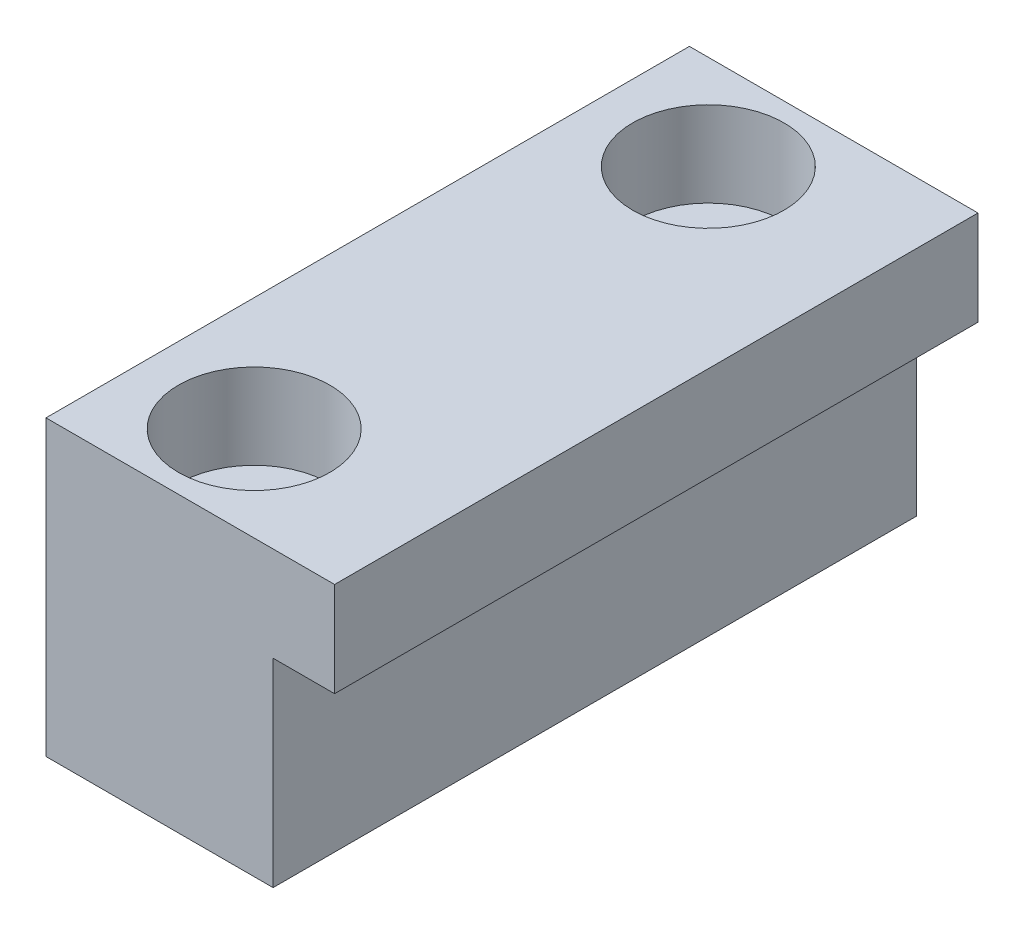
ISO-10303-21;
HEADER;
FILE_DESCRIPTION(('STEP AP214'),'2;1');
FILE_NAME('part.step','',(''),(''),'','','');
FILE_SCHEMA(('AUTOMOTIVE_DESIGN { 1 0 10303 214 1 1 1 1 }'));
ENDSEC;
DATA;
#1=APPLICATION_CONTEXT('core data for automotive mechanical design processes');
#2=APPLICATION_PROTOCOL_DEFINITION('international standard','automotive_design',2000,#1);
#3=PRODUCT_CONTEXT('',#1,'mechanical');
#4=PRODUCT('Part','Part','',(#3));
#5=PRODUCT_RELATED_PRODUCT_CATEGORY('part','',(#4));
#6=PRODUCT_DEFINITION_FORMATION('','',#4);
#7=PRODUCT_DEFINITION_CONTEXT('part definition',#1,'design');
#8=PRODUCT_DEFINITION('design','',#6,#7);
#9=PRODUCT_DEFINITION_SHAPE('','',#8);
#10=(LENGTH_UNIT() NAMED_UNIT(*) SI_UNIT(.MILLI.,.METRE.));
#11=(NAMED_UNIT(*) PLANE_ANGLE_UNIT() SI_UNIT($,.RADIAN.));
#12=(NAMED_UNIT(*) SI_UNIT($,.STERADIAN.) SOLID_ANGLE_UNIT());
#13=UNCERTAINTY_MEASURE_WITH_UNIT(LENGTH_MEASURE(1.E-05),#10,'distance_accuracy_value','');
#14=(GEOMETRIC_REPRESENTATION_CONTEXT(3) GLOBAL_UNCERTAINTY_ASSIGNED_CONTEXT((#13)) GLOBAL_UNIT_ASSIGNED_CONTEXT((#10,
#11,#12)) REPRESENTATION_CONTEXT('',''));
#15=CARTESIAN_POINT('',(0.,0.,0.));
#16=DIRECTION('',(0.,0.,1.));
#17=DIRECTION('',(1.,0.,0.));
#18=AXIS2_PLACEMENT_3D('',#15,#16,#17);
#19=CARTESIAN_POINT('',(6.,-18.5,5.));
#20=DIRECTION('',(0.,1.,0.));
#21=DIRECTION('',(0.,0.,1.));
#22=AXIS2_PLACEMENT_3D('',#19,#20,#21);
#23=CYLINDRICAL_SURFACE('',#22,2.25);
#24=CARTESIAN_POINT('',(6.,0.,5.));
#25=DIRECTION('',(0.,1.,0.));
#26=DIRECTION('',(0.,0.,1.));
#27=AXIS2_PLACEMENT_3D('',#24,#25,#26);
#28=CIRCLE('',#27,2.25);
#29=CARTESIAN_POINT('',(6.,0.,7.25));
#30=VERTEX_POINT('',#29);
#31=EDGE_CURVE('E137',#30,#30,#28,.T.);
#32=ORIENTED_EDGE('',*,*,#31,.F.);
#33=EDGE_LOOP('',(#32));
#34=FACE_BOUND('',#33,.T.);
#35=CARTESIAN_POINT('',(6.,11.,5.));
#36=DIRECTION('',(0.,1.,0.));
#37=DIRECTION('',(0.,0.,1.));
#38=AXIS2_PLACEMENT_3D('',#35,#36,#37);
#39=CIRCLE('',#38,2.25);
#40=CARTESIAN_POINT('',(6.,11.,7.25));
#41=VERTEX_POINT('',#40);
#42=EDGE_CURVE('E36',#41,#41,#39,.F.);
#43=ORIENTED_EDGE('',*,*,#42,.F.);
#44=EDGE_LOOP('',(#43));
#45=FACE_BOUND('',#44,.T.);
#46=ADVANCED_FACE('F32',(#34,#45),#23,.F.);
#47=CARTESIAN_POINT('',(6.,-18.5,29.));
#48=DIRECTION('',(0.,1.,0.));
#49=DIRECTION('',(0.,0.,1.));
#50=AXIS2_PLACEMENT_3D('',#47,#48,#49);
#51=CYLINDRICAL_SURFACE('',#50,2.25);
#52=CARTESIAN_POINT('',(6.,0.,29.));
#53=DIRECTION('',(0.,1.,0.));
#54=DIRECTION('',(0.,0.,1.));
#55=AXIS2_PLACEMENT_3D('',#52,#53,#54);
#56=CIRCLE('',#55,2.25);
#57=CARTESIAN_POINT('',(6.,0.,31.25));
#58=VERTEX_POINT('',#57);
#59=EDGE_CURVE('E123',#58,#58,#56,.T.);
#60=ORIENTED_EDGE('',*,*,#59,.F.);
#61=EDGE_LOOP('',(#60));
#62=FACE_BOUND('',#61,.T.);
#63=CARTESIAN_POINT('',(6.,11.,29.));
#64=DIRECTION('',(0.,1.,0.));
#65=DIRECTION('',(0.,0.,1.));
#66=AXIS2_PLACEMENT_3D('',#63,#64,#65);
#67=CIRCLE('',#66,2.25);
#68=CARTESIAN_POINT('',(6.,11.,31.25));
#69=VERTEX_POINT('',#68);
#70=EDGE_CURVE('E135',#69,#69,#67,.F.);
#71=ORIENTED_EDGE('',*,*,#70,.F.);
#72=EDGE_LOOP('',(#71));
#73=FACE_BOUND('',#72,.T.);
#74=ADVANCED_FACE('F179',(#62,#73),#51,.F.);
#75=CARTESIAN_POINT('',(0.,0.,34.));
#76=DIRECTION('',(0.,1.,0.));
#77=DIRECTION('',(0.,0.,1.));
#78=AXIS2_PLACEMENT_3D('',#75,#76,#77);
#79=PLANE('',#78);
#80=ORIENTED_EDGE('',*,*,#31,.T.);
#81=EDGE_LOOP('',(#80));
#82=FACE_BOUND('',#81,.T.);
#83=ORIENTED_EDGE('',*,*,#59,.T.);
#84=EDGE_LOOP('',(#83));
#85=FACE_BOUND('',#84,.T.);
#86=DIRECTION('',(1.,0.,0.));
#87=VECTOR('',#86,1.);
#88=CARTESIAN_POINT('',(0.,0.,0.));
#89=LINE('',#88,#87);
#90=CARTESIAN_POINT('',(0.,0.,0.));
#91=VERTEX_POINT('',#90);
#92=CARTESIAN_POINT('',(12.,0.,0.));
#93=VERTEX_POINT('',#92);
#94=EDGE_CURVE('E119',#91,#93,#89,.T.);
#95=ORIENTED_EDGE('',*,*,#94,.T.);
#96=DIRECTION('',(0.,0.,-1.));
#97=VECTOR('',#96,1.);
#98=CARTESIAN_POINT('',(12.,0.,34.));
#99=LINE('',#98,#97);
#100=CARTESIAN_POINT('',(12.,0.,34.));
#101=VERTEX_POINT('',#100);
#102=EDGE_CURVE('E11',#101,#93,#99,.T.);
#103=ORIENTED_EDGE('',*,*,#102,.F.);
#104=DIRECTION('',(1.,0.,0.));
#105=VECTOR('',#104,1.);
#106=CARTESIAN_POINT('',(0.,0.,34.));
#107=LINE('',#106,#105);
#108=CARTESIAN_POINT('',(0.,0.,34.));
#109=VERTEX_POINT('',#108);
#110=EDGE_CURVE('E130',#109,#101,#107,.T.);
#111=ORIENTED_EDGE('',*,*,#110,.F.);
#112=DIRECTION('',(0.,0.,-1.));
#113=VECTOR('',#112,1.);
#114=CARTESIAN_POINT('',(0.,0.,34.));
#115=LINE('',#114,#113);
#116=EDGE_CURVE('E115',#109,#91,#115,.T.);
#117=ORIENTED_EDGE('',*,*,#116,.T.);
#118=EDGE_LOOP('',(#95,#103,#111,#117));
#119=FACE_BOUND('',#118,.T.);
#120=ADVANCED_FACE('F34',(#82,#85,#119),#79,.F.);
#121=CARTESIAN_POINT('',(12.,0.,34.));
#122=DIRECTION('',(-1.,0.,0.));
#123=DIRECTION('',(0.,0.,1.));
#124=AXIS2_PLACEMENT_3D('',#121,#122,#123);
#125=PLANE('',#124);
#126=DIRECTION('',(0.,1.,0.));
#127=VECTOR('',#126,1.);
#128=CARTESIAN_POINT('',(12.,0.,0.));
#129=LINE('',#128,#127);
#130=CARTESIAN_POINT('',(12.,10.5,0.));
#131=VERTEX_POINT('',#130);
#132=EDGE_CURVE('E122',#93,#131,#129,.T.);
#133=ORIENTED_EDGE('',*,*,#132,.T.);
#134=DIRECTION('',(0.,0.,-1.));
#135=VECTOR('',#134,1.);
#136=CARTESIAN_POINT('',(12.,10.5,34.));
#137=LINE('',#136,#135);
#138=CARTESIAN_POINT('',(12.,10.5,34.));
#139=VERTEX_POINT('',#138);
#140=EDGE_CURVE('E42',#139,#131,#137,.T.);
#141=ORIENTED_EDGE('',*,*,#140,.F.);
#142=DIRECTION('',(0.,1.,0.));
#143=VECTOR('',#142,1.);
#144=CARTESIAN_POINT('',(12.,0.,34.));
#145=LINE('',#144,#143);
#146=EDGE_CURVE('E88',#101,#139,#145,.T.);
#147=ORIENTED_EDGE('',*,*,#146,.F.);
#148=ORIENTED_EDGE('',*,*,#102,.T.);
#149=EDGE_LOOP('',(#133,#141,#147,#148));
#150=FACE_BOUND('',#149,.T.);
#151=ADVANCED_FACE('F159',(#150),#125,.F.);
#152=CARTESIAN_POINT('',(12.,10.5,34.));
#153=DIRECTION('',(0.,1.,0.));
#154=DIRECTION('',(0.,0.,1.));
#155=AXIS2_PLACEMENT_3D('',#152,#153,#154);
#156=PLANE('',#155);
#157=DIRECTION('',(1.,0.,0.));
#158=VECTOR('',#157,1.);
#159=CARTESIAN_POINT('',(12.,10.5,0.));
#160=LINE('',#159,#158);
#161=CARTESIAN_POINT('',(15.25,10.5,0.));
#162=VERTEX_POINT('',#161);
#163=EDGE_CURVE('E125',#131,#162,#160,.T.);
#164=ORIENTED_EDGE('',*,*,#163,.T.);
#165=DIRECTION('',(0.,0.,-1.));
#166=VECTOR('',#165,1.);
#167=CARTESIAN_POINT('',(15.25,10.5,34.));
#168=LINE('',#167,#166);
#169=CARTESIAN_POINT('',(15.25,10.5,34.));
#170=VERTEX_POINT('',#169);
#171=EDGE_CURVE('E110',#170,#162,#168,.T.);
#172=ORIENTED_EDGE('',*,*,#171,.F.);
#173=DIRECTION('',(1.,0.,0.));
#174=VECTOR('',#173,1.);
#175=CARTESIAN_POINT('',(12.,10.5,34.));
#176=LINE('',#175,#174);
#177=EDGE_CURVE('E101',#139,#170,#176,.T.);
#178=ORIENTED_EDGE('',*,*,#177,.F.);
#179=ORIENTED_EDGE('',*,*,#140,.T.);
#180=EDGE_LOOP('',(#164,#172,#178,#179));
#181=FACE_BOUND('',#180,.T.);
#182=ADVANCED_FACE('F162',(#181),#156,.F.);
#183=CARTESIAN_POINT('',(15.25,10.5,34.));
#184=DIRECTION('',(-1.,0.,0.));
#185=DIRECTION('',(0.,0.,1.));
#186=AXIS2_PLACEMENT_3D('',#183,#184,#185);
#187=PLANE('',#186);
#188=DIRECTION('',(0.,1.,0.));
#189=VECTOR('',#188,1.);
#190=CARTESIAN_POINT('',(15.25,10.5,0.));
#191=LINE('',#190,#189);
#192=CARTESIAN_POINT('',(15.25,15.5,0.));
#193=VERTEX_POINT('',#192);
#194=EDGE_CURVE('E109',#162,#193,#191,.T.);
#195=ORIENTED_EDGE('',*,*,#194,.T.);
#196=DIRECTION('',(0.,0.,-1.));
#197=VECTOR('',#196,1.);
#198=CARTESIAN_POINT('',(15.25,15.5,34.));
#199=LINE('',#198,#197);
#200=CARTESIAN_POINT('',(15.25,15.5,34.));
#201=VERTEX_POINT('',#200);
#202=EDGE_CURVE('E106',#201,#193,#199,.T.);
#203=ORIENTED_EDGE('',*,*,#202,.F.);
#204=DIRECTION('',(0.,1.,0.));
#205=VECTOR('',#204,1.);
#206=CARTESIAN_POINT('',(15.25,10.5,34.));
#207=LINE('',#206,#205);
#208=EDGE_CURVE('E95',#170,#201,#207,.T.);
#209=ORIENTED_EDGE('',*,*,#208,.F.);
#210=ORIENTED_EDGE('',*,*,#171,.T.);
#211=EDGE_LOOP('',(#195,#203,#209,#210));
#212=FACE_BOUND('',#211,.T.);
#213=ADVANCED_FACE('F107',(#212),#187,.F.);
#214=CARTESIAN_POINT('',(0.,15.5,34.));
#215=DIRECTION('',(0.,-1.,0.));
#216=DIRECTION('',(0.,0.,-1.));
#217=AXIS2_PLACEMENT_3D('',#214,#215,#216);
#218=PLANE('',#217);
#219=CARTESIAN_POINT('',(6.,15.5,5.));
#220=DIRECTION('',(0.,1.,0.));
#221=DIRECTION('',(0.,0.,1.));
#222=AXIS2_PLACEMENT_3D('',#219,#220,#221);
#223=CIRCLE('',#222,4.);
#224=CARTESIAN_POINT('',(6.,15.5,9.));
#225=VERTEX_POINT('',#224);
#226=EDGE_CURVE('E151',#225,#225,#223,.T.);
#227=ORIENTED_EDGE('',*,*,#226,.F.);
#228=EDGE_LOOP('',(#227));
#229=FACE_BOUND('',#228,.T.);
#230=CARTESIAN_POINT('',(6.,15.5,29.));
#231=DIRECTION('',(0.,1.,0.));
#232=DIRECTION('',(0.,0.,1.));
#233=AXIS2_PLACEMENT_3D('',#230,#231,#232);
#234=CIRCLE('',#233,4.);
#235=CARTESIAN_POINT('',(6.,15.5,33.));
#236=VERTEX_POINT('',#235);
#237=EDGE_CURVE('E144',#236,#236,#234,.T.);
#238=ORIENTED_EDGE('',*,*,#237,.F.);
#239=EDGE_LOOP('',(#238));
#240=FACE_BOUND('',#239,.T.);
#241=DIRECTION('',(-1.,0.,0.));
#242=VECTOR('',#241,1.);
#243=CARTESIAN_POINT('',(0.,15.5,0.));
#244=LINE('',#243,#242);
#245=CARTESIAN_POINT('',(0.,15.5,0.));
#246=VERTEX_POINT('',#245);
#247=EDGE_CURVE('E74',#193,#246,#244,.T.);
#248=ORIENTED_EDGE('',*,*,#247,.T.);
#249=DIRECTION('',(0.,0.,-1.));
#250=VECTOR('',#249,1.);
#251=CARTESIAN_POINT('',(0.,15.5,34.));
#252=LINE('',#251,#250);
#253=CARTESIAN_POINT('',(0.,15.5,34.));
#254=VERTEX_POINT('',#253);
#255=EDGE_CURVE('E111',#254,#246,#252,.T.);
#256=ORIENTED_EDGE('',*,*,#255,.F.);
#257=DIRECTION('',(-1.,0.,0.));
#258=VECTOR('',#257,1.);
#259=CARTESIAN_POINT('',(0.,15.5,34.));
#260=LINE('',#259,#258);
#261=EDGE_CURVE('E99',#201,#254,#260,.T.);
#262=ORIENTED_EDGE('',*,*,#261,.F.);
#263=ORIENTED_EDGE('',*,*,#202,.T.);
#264=EDGE_LOOP('',(#248,#256,#262,#263));
#265=FACE_BOUND('',#264,.T.);
#266=ADVANCED_FACE('F113',(#229,#240,#265),#218,.F.);
#267=CARTESIAN_POINT('',(0.,0.,34.));
#268=DIRECTION('',(1.,0.,0.));
#269=DIRECTION('',(0.,0.,-1.));
#270=AXIS2_PLACEMENT_3D('',#267,#268,#269);
#271=PLANE('',#270);
#272=DIRECTION('',(0.,-1.,0.));
#273=VECTOR('',#272,1.);
#274=CARTESIAN_POINT('',(0.,0.,0.));
#275=LINE('',#274,#273);
#276=EDGE_CURVE('E80',#246,#91,#275,.T.);
#277=ORIENTED_EDGE('',*,*,#276,.T.);
#278=ORIENTED_EDGE('',*,*,#116,.F.);
#279=DIRECTION('',(0.,-1.,0.));
#280=VECTOR('',#279,1.);
#281=CARTESIAN_POINT('',(0.,0.,34.));
#282=LINE('',#281,#280);
#283=EDGE_CURVE('E51',#254,#109,#282,.T.);
#284=ORIENTED_EDGE('',*,*,#283,.F.);
#285=ORIENTED_EDGE('',*,*,#255,.T.);
#286=EDGE_LOOP('',(#277,#278,#284,#285));
#287=FACE_BOUND('',#286,.T.);
#288=ADVANCED_FACE('F167',(#287),#271,.F.);
#289=CARTESIAN_POINT('',(12.,0.,34.));
#290=DIRECTION('',(0.,0.,1.));
#291=DIRECTION('',(1.,0.,0.));
#292=AXIS2_PLACEMENT_3D('',#289,#290,#291);
#293=PLANE('',#292);
#294=ORIENTED_EDGE('',*,*,#110,.T.);
#295=ORIENTED_EDGE('',*,*,#146,.T.);
#296=ORIENTED_EDGE('',*,*,#177,.T.);
#297=ORIENTED_EDGE('',*,*,#208,.T.);
#298=ORIENTED_EDGE('',*,*,#261,.T.);
#299=ORIENTED_EDGE('',*,*,#283,.T.);
#300=EDGE_LOOP('',(#294,#295,#296,#297,#298,#299));
#301=FACE_BOUND('',#300,.T.);
#302=ADVANCED_FACE('F97',(#301),#293,.T.);
#303=CARTESIAN_POINT('',(12.,0.,0.));
#304=DIRECTION('',(0.,0.,1.));
#305=DIRECTION('',(1.,0.,0.));
#306=AXIS2_PLACEMENT_3D('',#303,#304,#305);
#307=PLANE('',#306);
#308=ORIENTED_EDGE('',*,*,#94,.F.);
#309=ORIENTED_EDGE('',*,*,#276,.F.);
#310=ORIENTED_EDGE('',*,*,#247,.F.);
#311=ORIENTED_EDGE('',*,*,#194,.F.);
#312=ORIENTED_EDGE('',*,*,#163,.F.);
#313=ORIENTED_EDGE('',*,*,#132,.F.);
#314=EDGE_LOOP('',(#308,#309,#310,#311,#312,#313));
#315=FACE_BOUND('',#314,.T.);
#316=ADVANCED_FACE('F165',(#315),#307,.F.);
#317=CARTESIAN_POINT('',(6.,11.,29.));
#318=DIRECTION('',(0.,1.,0.));
#319=DIRECTION('',(0.,0.,1.));
#320=AXIS2_PLACEMENT_3D('',#317,#318,#319);
#321=PLANE('',#320);
#322=CARTESIAN_POINT('',(6.,11.,29.));
#323=DIRECTION('',(0.,1.,0.));
#324=DIRECTION('',(0.,0.,1.));
#325=AXIS2_PLACEMENT_3D('',#322,#323,#324);
#326=CIRCLE('',#325,4.);
#327=CARTESIAN_POINT('',(6.,11.,33.));
#328=VERTEX_POINT('',#327);
#329=EDGE_CURVE('E138',#328,#328,#326,.T.);
#330=ORIENTED_EDGE('',*,*,#329,.T.);
#331=EDGE_LOOP('',(#330));
#332=FACE_BOUND('',#331,.T.);
#333=ORIENTED_EDGE('',*,*,#70,.T.);
#334=EDGE_LOOP('',(#333));
#335=FACE_BOUND('',#334,.T.);
#336=ADVANCED_FACE('F193',(#332,#335),#321,.T.);
#337=CARTESIAN_POINT('',(6.,11.,29.));
#338=DIRECTION('',(0.,1.,0.));
#339=DIRECTION('',(0.,0.,1.));
#340=AXIS2_PLACEMENT_3D('',#337,#338,#339);
#341=CYLINDRICAL_SURFACE('',#340,4.);
#342=ORIENTED_EDGE('',*,*,#329,.F.);
#343=EDGE_LOOP('',(#342));
#344=FACE_BOUND('',#343,.T.);
#345=ORIENTED_EDGE('',*,*,#237,.T.);
#346=EDGE_LOOP('',(#345));
#347=FACE_BOUND('',#346,.T.);
#348=ADVANCED_FACE('F190',(#344,#347),#341,.F.);
#349=CARTESIAN_POINT('',(6.,11.,5.));
#350=DIRECTION('',(0.,1.,0.));
#351=DIRECTION('',(0.,0.,1.));
#352=AXIS2_PLACEMENT_3D('',#349,#350,#351);
#353=PLANE('',#352);
#354=CARTESIAN_POINT('',(6.,11.,5.));
#355=DIRECTION('',(0.,1.,0.));
#356=DIRECTION('',(0.,0.,1.));
#357=AXIS2_PLACEMENT_3D('',#354,#355,#356);
#358=CIRCLE('',#357,4.);
#359=CARTESIAN_POINT('',(6.,11.,9.));
#360=VERTEX_POINT('',#359);
#361=EDGE_CURVE('E214',#360,#360,#358,.T.);
#362=ORIENTED_EDGE('',*,*,#361,.T.);
#363=EDGE_LOOP('',(#362));
#364=FACE_BOUND('',#363,.T.);
#365=ORIENTED_EDGE('',*,*,#42,.T.);
#366=EDGE_LOOP('',(#365));
#367=FACE_BOUND('',#366,.T.);
#368=ADVANCED_FACE('F200',(#364,#367),#353,.T.);
#369=CARTESIAN_POINT('',(6.,11.,5.));
#370=DIRECTION('',(0.,1.,0.));
#371=DIRECTION('',(0.,0.,1.));
#372=AXIS2_PLACEMENT_3D('',#369,#370,#371);
#373=CYLINDRICAL_SURFACE('',#372,4.);
#374=ORIENTED_EDGE('',*,*,#361,.F.);
#375=EDGE_LOOP('',(#374));
#376=FACE_BOUND('',#375,.T.);
#377=ORIENTED_EDGE('',*,*,#226,.T.);
#378=EDGE_LOOP('',(#377));
#379=FACE_BOUND('',#378,.T.);
#380=ADVANCED_FACE('F203',(#376,#379),#373,.F.);
#381=CLOSED_SHELL('',(#46,#74,#120,#151,#182,#213,#266,#288,#302,#316,#336,#348,#368,#380));
#382=MANIFOLD_SOLID_BREP('B2',#381);
#383=ADVANCED_BREP_SHAPE_REPRESENTATION('',(#18,#382),#14);
#384=SHAPE_DEFINITION_REPRESENTATION(#9,#383);
ENDSEC;
END-ISO-10303-21;
